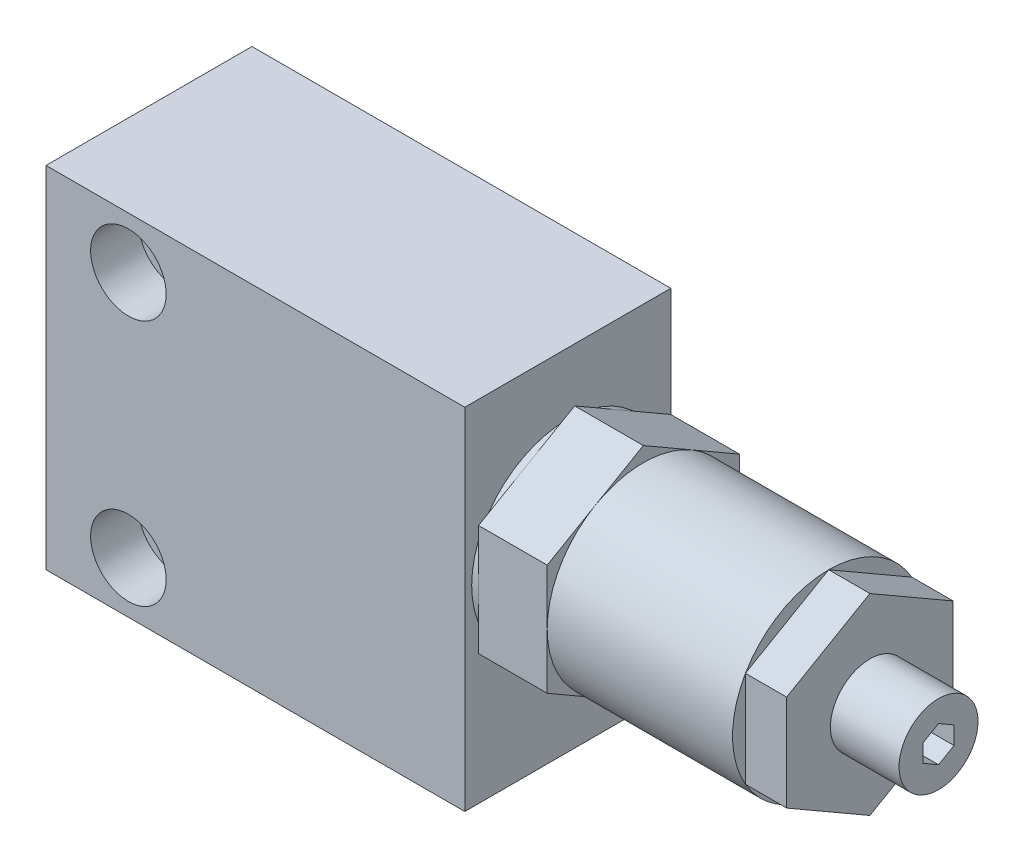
from build123d import *

# Parameters (mm, degrees)
SKETCH1_W                      = 61
SKETCH1_H                      = 51
EXTRUDE1_DEPTH                 = 30
SKETCH2_R                      = 14
EXTRUDE2_DEPTH                 = 44
G1_4_TAPPED_HOLE1_D            = 11.445
G1_4_TAPPED_HOLE1_DEPTH        = 19.01
G1_4_TAPPED_HOLE1_TIP          = 3.438424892
CBORE_FOR_M6_SHCS1_D           = 6.6
CBORE_FOR_M6_SHCS1_CBORE_D     = 11
CBORE_FOR_M6_SHCS1_CBORE_DEPTH = 7
SKETCH5_R                      = 6
CUT_EXTRUDE1_DEPTH             = 1.5
SKETCH6_R                      = 6
CUT_EXTRUDE2_DEPTH             = 1.5
SKETCH7_R                      = 1.5
CUT_EXTRUDE3_DEPTH             = 10
G1_4_TAPPED_HOLE2_D            = 11.445
G1_4_TAPPED_HOLE2_DEPTH        = 19.01
G1_4_TAPPED_HOLE2_TIP          = 3.438424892
SKETCH14_R                     = 7
CUT_EXTRUDE4_DEPTH             = 1.5
SKETCH15_R                     = 7
CUT_EXTRUDE5_DEPTH             = 1.5
CUT_EXTRUDE6_START             = -6
CUT_EXTRUDE6_DEPTH             = 6
BOSS_EXTRUDE1_START            = 1
BOSS_EXTRUDE1_DEPTH            = 10
SKETCH19_R                     = 5.75
BOSS_EXTRUDE2_DEPTH            = 10
CUT_EXTRUDE7_DEPTH             = 5


with BuildPart() as part:
    # Sketch1 → Extrude1 (new body)
    with BuildSketch(Plane.XY):
        with Locations((30.5, -25.5)):
            Rectangle(SKETCH1_W, SKETCH1_H)
    extrude(amount=EXTRUDE1_DEPTH)

    # Sketch2 → Extrude2 (add)
    with BuildSketch(Plane(origin=(61, 0, 0), x_dir=(0, 0, -1), z_dir=(1, 0, 0))):
        with Locations(Location((-15, -23, 0), (0, 0, 270))):
            Circle(SKETCH2_R)
    extrude(amount=EXTRUDE2_DEPTH)

    # G1_4 Tapped Hole1
    with Locations(Plane.ZY):
        with Locations((15, -23)):
            Hole(G1_4_TAPPED_HOLE1_D / 2, depth=G1_4_TAPPED_HOLE1_DEPTH)
            with Locations((0, 0, -(G1_4_TAPPED_HOLE1_DEPTH + G1_4_TAPPED_HOLE1_TIP / 2))):  # 118° drill point
                Cone(0, G1_4_TAPPED_HOLE1_D / 2, G1_4_TAPPED_HOLE1_TIP, mode=Mode.SUBTRACT)

    # CBORE for M6 SHCS1 (through all)
    with Locations(Plane.XY.offset(30)):
        with Locations((12, -43.5), (12, -7.5)):
            CounterBoreHole(CBORE_FOR_M6_SHCS1_D / 2, CBORE_FOR_M6_SHCS1_CBORE_D / 2, CBORE_FOR_M6_SHCS1_CBORE_DEPTH)

    # Sketch5 → Cut-Extrude1 (cut)
    with BuildSketch(Plane(origin=(0, 0, 0), x_dir=(-1, 0, 0), z_dir=(0, 0, -1))):
        with Locations((-35.5, -39)):
            Circle(SKETCH5_R)
    extrude(amount=-CUT_EXTRUDE1_DEPTH, mode=Mode.SUBTRACT)

    # Sketch6 → Cut-Extrude2 (cut)
    with BuildSketch(Plane(origin=(0, 0, 0), x_dir=(-1, 0, 0), z_dir=(0, 0, -1))):
        with Locations((-12, -23)):
            Circle(SKETCH6_R)
    extrude(amount=-CUT_EXTRUDE2_DEPTH, mode=Mode.SUBTRACT)

    # Sketch7 → Cut-Extrude3 (cut)
    with BuildSketch(Plane(origin=(0, 0, 1.5), x_dir=(-1, 0, 0), z_dir=(0, 0, -1))):
        with Locations((-35.5, -39)):
            Circle(SKETCH7_R)
        with Locations((-12, -23)):
            Circle(SKETCH7_R)
    extrude(amount=-CUT_EXTRUDE3_DEPTH, mode=Mode.SUBTRACT)

    # G1_4 Tapped Hole2
    with Locations(Plane.XZ.offset(51)):
        with Locations((35.5, 15)):
            Hole(G1_4_TAPPED_HOLE2_D / 2, depth=G1_4_TAPPED_HOLE2_DEPTH)
            with Locations((0, 0, -(G1_4_TAPPED_HOLE2_DEPTH + G1_4_TAPPED_HOLE2_TIP / 2))):  # 118° drill point
                Cone(0, G1_4_TAPPED_HOLE2_D / 2, G1_4_TAPPED_HOLE2_TIP, mode=Mode.SUBTRACT)

    # Sketch14 → Cut-Extrude4 (cut)
    with BuildSketch(Plane.XZ.offset(51)):
        with Locations(Location((35.5, 15, 0), (0, 0, 270))):
            Circle(SKETCH14_R)
    extrude(amount=-CUT_EXTRUDE4_DEPTH, mode=Mode.SUBTRACT)

    # Sketch15 → Cut-Extrude5 (cut)
    with BuildSketch(Plane.ZY):
        with Locations(Location((15, -23, 0), (0, 0, 270))):
            Circle(SKETCH15_R)
    extrude(amount=-CUT_EXTRUDE5_DEPTH, mode=Mode.SUBTRACT)

    # Sketch16 → Cut-Extrude6 (cut)
    with BuildSketch(Plane(origin=(105, 0, 0), x_dir=(0, 0, -1), z_dir=(1, 0, 0)).offset(CUT_EXTRUDE6_START)):
        with BuildLine():
            Line((-15, -37), (-27.124355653, -30))
            ThreePointArc((-27.124355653, -30), (-22, -35.124355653), (-15, -37))
        make_face()
        with BuildLine():
            Line((-27.124355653, -30), (-27.124355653, -16))
            ThreePointArc((-27.124355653, -16), (-29, -23), (-27.124355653, -30))
        make_face()
        with BuildLine():
            Line((-27.124355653, -16), (-15, -9))
            ThreePointArc((-15, -9), (-22, -10.875644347), (-27.124355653, -16))
        make_face()
        with BuildLine():
            ThreePointArc((-2.875644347, -16), (-8, -10.875644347), (-15, -9))
            Line((-15, -9), (-2.875644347, -16))
        make_face()
        with BuildLine():
            ThreePointArc((-1, -23), (-1.477038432, -19.376533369), (-2.875644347, -16))
            Line((-2.875644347, -16), (-2.875644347, -30))
            ThreePointArc((-2.875644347, -30), (-1.477038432, -26.623466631), (-1, -23))
        make_face()
        with BuildLine():
            ThreePointArc((-15, -37), (-8, -35.124355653), (-2.875644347, -30))
            Line((-2.875644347, -30), (-15, -37))
        make_face()
    extrude(amount=CUT_EXTRUDE6_DEPTH, mode=Mode.SUBTRACT)

    # Sketch18 → Boss-Extrude1 (add)
    with BuildSketch(Plane(origin=(61, 0, 0), x_dir=(0, 0, -1), z_dir=(1, 0, 0)).offset(BOSS_EXTRUDE1_START)):
        Polygon((-15, -6.834192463), (-29, -14.917096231), (-29, -31.082903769), (-15, -39.165807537), (-1, -31.082903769), (-1, -14.917096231), align=None)
    extrude(amount=BOSS_EXTRUDE1_DEPTH)

    # Sketch19 → Boss-Extrude2 (add)
    with BuildSketch(Plane(origin=(105, 0, 0), x_dir=(0, 0, -1), z_dir=(1, 0, 0))):
        with Locations(Location((-15, -23, 0), (0, 0, 90))):
            Circle(SKETCH19_R)
    extrude(amount=BOSS_EXTRUDE2_DEPTH)

    # Sketch20 → Cut-Extrude7 (cut)
    with BuildSketch(Plane(origin=(115, 0, 0), x_dir=(0, 0, -1), z_dir=(1, 0, 0))):
        Polygon((-15, -20.401923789), (-17.25, -21.700961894), (-17.25, -24.299038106), (-15, -25.598076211), (-12.75, -24.299038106), (-12.75, -21.700961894), align=None)
    extrude(amount=-CUT_EXTRUDE7_DEPTH, mode=Mode.SUBTRACT)


solid = part.part
